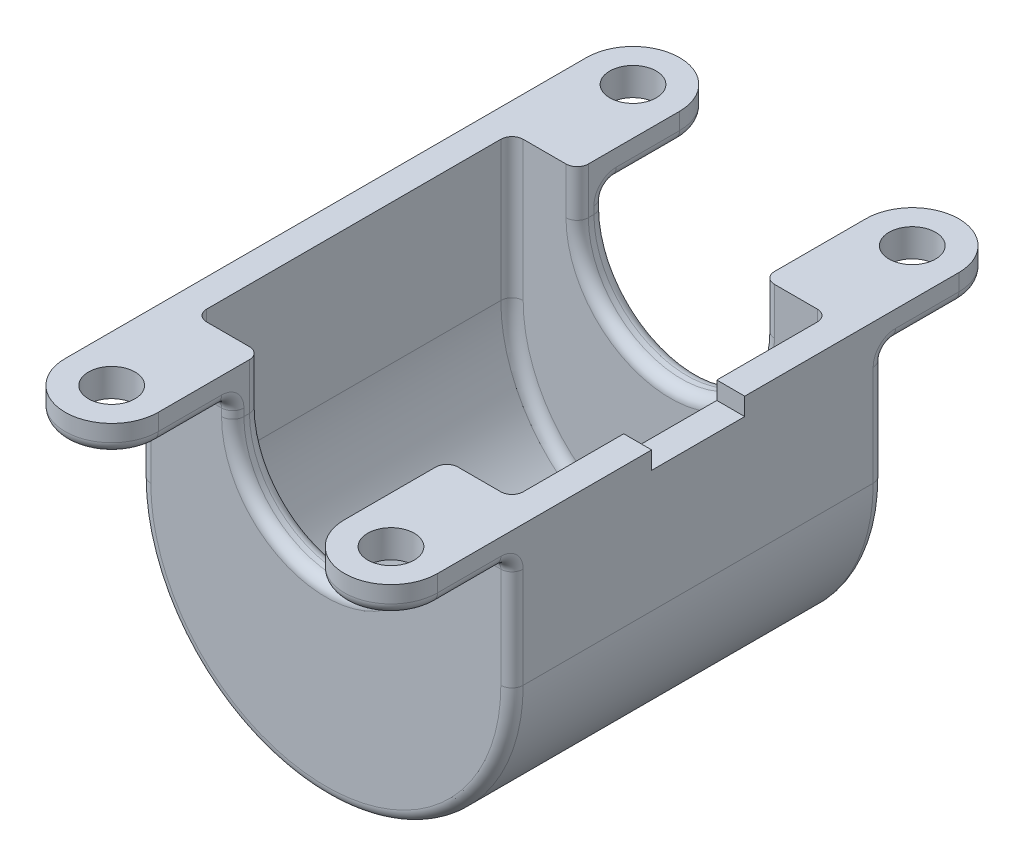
from build123d import *

# Parameters (mm, degrees)
BASE_EXTRUDE_DEPTH      = 50.8
SHELL1_T                = -7.62
BOSS_EXTRUDE1_DEPTH     = 7.62
SKETCH3_R               = 6.35
CUT_EXTRUDE1_DEPTH      = 133.324005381
MIRROR2_COPY_1_DEPTH    = 7.62
MIRROR2_COPY_2_SKETCH_R = 6.35
MIRROR2_COPY_2_DEPTH    = 133.324005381
CUT_EXTRUDE2_REACH      = 143.17
SKETCH4_W               = 25.4
SKETCH4_H               = 4.826
FILLET1_R               = 3.048
FILLET2_R               = 3.048


with BuildPart() as part:
    # Sketch1 → Base-Extrude (new, symmetric)
    with BuildSketch(Plane.XY):
        with BuildLine():
            Line((-50.8, 0), (-50.8, 38.1))
            Line((-50.8, 38.1), (-25.4, 38.1))
            Line((-25.4, 38.1), (-25.4, 25.4))
            ThreePointArc((-25.4, 25.4), (0, 0), (25.4, 25.4))
            Line((25.4, 25.4), (25.4, 38.1))
            Line((25.4, 38.1), (50.8, 38.1))
            Line((50.8, 38.1), (50.8, 0))
            ThreePointArc((50.8, 0), (0, -50.8), (-50.8, 0))
        make_face()
    extrude(amount=BASE_EXTRUDE_DEPTH, both=True)

    # Shell1
    shell1_openings = [part.faces().sort_by_distance(p)[0] for p in [
        (-38.1, 38.1, 0),
        (-25.4, 31.75, 0),
        (0, 0, 0),
        (25.4, 31.75, 0),
        (38.1, 38.1, 0),
    ]]
    offset(amount=SHELL1_T, openings=shell1_openings, kind=Kind.INTERSECTION)

    # Sketch2 → Boss-Extrude1 (add)
    with BuildSketch(Plane(origin=(0, 38.1, 0), x_dir=(-1, 0, 0), z_dir=(0, 1, 0))):
        with BuildLine():
            Line((50.8, 50.8), (50.8, 71.12))
            ThreePointArc((50.8, 71.12), (38.1, 83.82), (25.4, 71.12))
            Line((25.4, 71.12), (25.4, 50.8))
            Line((25.4, 50.8), (50.8, 50.8))
        make_face()
    boss_extrude1 = extrude(amount=-BOSS_EXTRUDE1_DEPTH)

    # Sketch3 → Cut-Extrude1 (cut, through all)
    with BuildSketch(Plane(origin=(0, 38.1, 0), x_dir=(-1, 0, 0), z_dir=(0, 1, 0))):
        with Locations(Location((38.1, 71.12, 0), (0, 0, 90))):
            Circle(SKETCH3_R)
    cut_extrude1 = extrude(amount=-CUT_EXTRUDE1_DEPTH, mode=Mode.SUBTRACT)

    # Mirror1: Boss-Extrude1, Cut-Extrude1 across plane
    add(boss_extrude1.mirror(Plane(origin=(0, 0, 0), x_dir=(0, 0, 1), z_dir=(1, 0, 0))))
    add(cut_extrude1.mirror(Plane(origin=(0, 0, 0), x_dir=(0, 0, 1), z_dir=(1, 0, 0))), mode=Mode.SUBTRACT)

    # Mirror2: Boss-Extrude1, Cut-Extrude1 across plane
    add(boss_extrude1.mirror(Plane.XY))
    add(cut_extrude1.mirror(Plane.XY), mode=Mode.SUBTRACT)

    # Mirror2 copy 1 sketch → Mirror2 copy 1 (add)
    with BuildSketch(Plane(origin=(0, 38.1, 0), x_dir=(1, 0, 0), z_dir=(0, 1, 0))):
        with BuildLine():
            Line((50.8, 50.8), (50.8, 71.12))
            ThreePointArc((50.8, 71.12), (38.1, 83.82), (25.4, 71.12))
            Line((25.4, 71.12), (25.4, 50.8))
            Line((25.4, 50.8), (50.8, 50.8))
        make_face()
    extrude(amount=-MIRROR2_COPY_1_DEPTH)

    # Mirror2 copy 2 sketch → Mirror2 copy 2 (cut, through all)
    with BuildSketch(Plane(origin=(0, 38.1, 0), x_dir=(1, 0, 0), z_dir=(0, 1, 0))):
        with Locations(Location((38.1, 71.12, 0), (0, 0, 90))):
            Circle(MIRROR2_COPY_2_SKETCH_R)
    extrude(amount=-MIRROR2_COPY_2_DEPTH, mode=Mode.SUBTRACT)

    # Sketch4 → Cut-Extrude2 (cut, up to next)
    with BuildSketch(Plane(origin=(50.8, 0, 0), x_dir=(0, 0, -1), z_dir=(1, 0, 0)), mode=Mode.PRIVATE) as cut_extrude2_sk1:
        with Locations((0, 35.687)):
            Rectangle(SKETCH4_W, SKETCH4_H)
    cut_extrude2_tool1 = extrude(cut_extrude2_sk1.sketch, amount=-CUT_EXTRUDE2_REACH, mode=Mode.PRIVATE) & part.part
    add(cut_extrude2_tool1.solids().sort_by_distance((50.8, 35.687, 0))[0], mode=Mode.SUBTRACT)

    # Fillet1
    fillet1_edges = [part.edges().sort_by_distance(p)[0] for p in [
        (-38.1, 30.48, -50.8),
        (-38.1, 30.48, 50.8),
        (38.1, 30.48, 50.8),
        (38.1, 30.48, -50.8),
    ]]
    fillet(fillet1_edges, radius=FILLET1_R)

    # Fillet2
    fillet2_edges = [part.edges().sort_by_distance(p)[0] for p in [
        (-38.1, 30.48, -83.82),
        (-25.4, 30.48, -62.484),
        (-50.8, 30.48, -62.484),
        (25.4, 26.416, -50.8),
        (-50.8, 13.716, -50.8),
        (50.8, 30.48, -62.484),
        (50.8, 30.48, 62.484),
        (25.4, 26.416, 50.8),
        (-50.8, 13.716, 50.8),
        (-50.8, 30.48, 62.484),
        (-50.8, 29.587261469, -51.692738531),
        (-25.4, 29.587261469, -51.692738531),
        (50.8, 29.587261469, -51.692738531),
        (25.4, 29.587261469, -51.692738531),
        (50.8, 29.587261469, 51.692738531),
        (25.4, 29.587261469, 51.692738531),
        (-50.8, 29.587261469, 51.692738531),
        (-25.4, 29.587261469, 51.692738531),
        (0, 0, 50.8),
        (-25.4, 26.416, 50.8),
        (0, -43.18, -43.18),
        (43.18, 19.05, -43.18),
        (25.4, 31.75, -43.18),
        (0, 0, -43.18),
        (-25.4, 31.75, -43.18),
        (-43.18, 19.05, -43.18),
        (0, -43.18, 43.18),
        (43.18, 19.05, 43.18),
        (25.4, 31.75, 43.18),
        (0, 0, 43.18),
        (-25.4, 31.75, 43.18),
        (-43.18, 19.05, 43.18),
        (0, -50.8, 50.8),
        (-25.4, 30.48, 62.484),
        (-38.1, 30.48, 83.82),
        (38.1, 30.48, 83.82),
        (25.4, 30.48, 62.484),
        (50.8, 13.716, 50.8),
        (-25.4, 26.416, -50.8),
        (0, 0, -50.8),
        (25.4, 30.48, -62.484),
        (38.1, 30.48, -83.82),
        (50.8, 13.716, -50.8),
        (0, -50.8, -50.8),
    ]]
    fillet(fillet2_edges, radius=FILLET2_R)


solid = part.part
